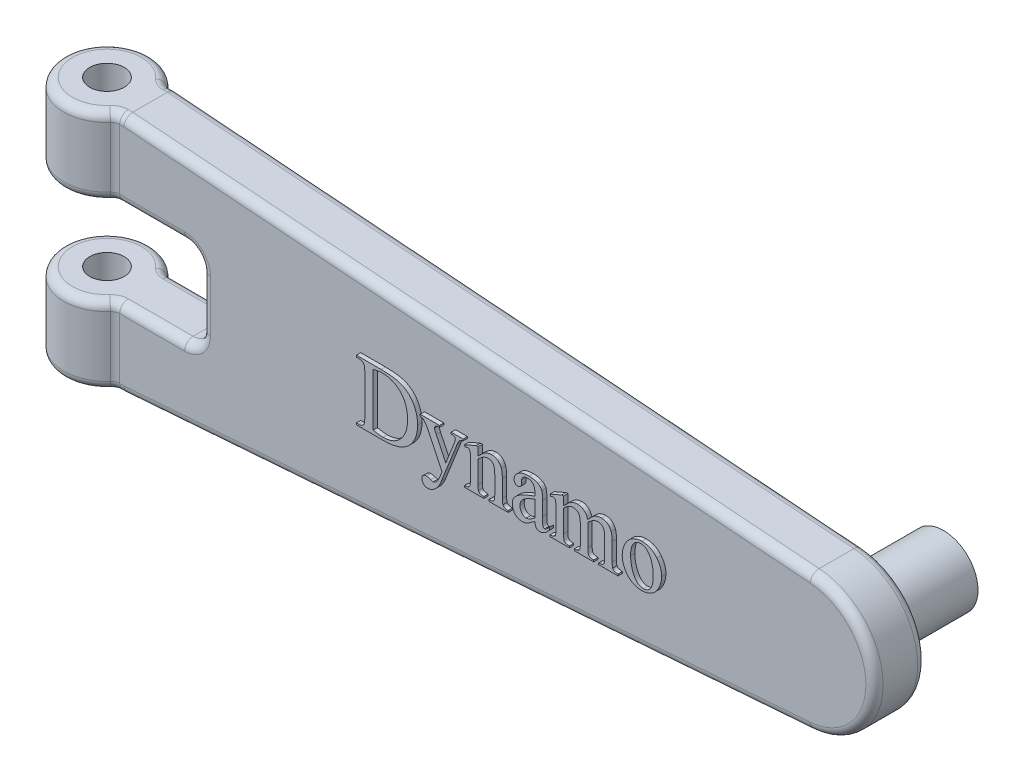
from build123d import *

# Parameters (mm, degrees)
BOSS_EXTRU_1_DEPTH      = 3
ESQUISSE2_R             = 2.5
BOSS_EXTRU_2_DEPTH      = 4.5
ESQUISSE3_R             = 1
ENL_V_MAT_EXTRU_1_DEPTH = 49.249352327
CONG_1_R                = 0.5
BOSS_EXTRU_3_DEPTH      = 0.25
ESQUISSE5_R             = 2
BOSS_EXTRU_4_DEPTH      = 5
TROU_TARAUD_M21_D       = 1.6
TROU_TARAUD_M21_DEPTH   = 6
TROU_TARAUD_M21_TIP     = 0.480688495


with BuildPart() as part:
    # Esquisse1 → Boss.-Extru.1 (new body)
    with BuildSketch(Plane.XY):
        with BuildLine():
            Line((0, 7), (2.5, 7))
            Line((2.5, 7), (42.301777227, 3.988600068))
            ThreePointArc((42.301777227, 3.988600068), (46, 0), (42.301777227, -3.988600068))
            Line((42.301777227, -3.988600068), (2.5, -7))
            Line((2.5, -7), (0, -7))
            Line((0, -7), (0, -2.5))
            Line((0, -2.5), (6, -2.5))
            ThreePointArc((6, -2.5), (6.707106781, -2.207106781), (7, -1.5))
            Line((7, -1.5), (7, 1.5))
            ThreePointArc((7, 1.5), (6.707106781, 2.207106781), (6, 2.5))
            Line((6, 2.5), (0, 2.5))
            Line((0, 2.5), (0, 7))
        make_face()
    extrude(amount=BOSS_EXTRU_1_DEPTH)

    # Esquisse2 → Boss.-Extru.2 (add)
    with BuildSketch(Plane(origin=(0, 7, 0), x_dir=(1, 0, 0), z_dir=(0, 1, 0))):
        with Locations((0, -1.5)):
            Circle(ESQUISSE2_R)
    boss_extru_2 = extrude(amount=-BOSS_EXTRU_2_DEPTH)

    # Sym_trie1: Boss.-Extru.2 across plane
    add(boss_extru_2.mirror(Plane.ZX))

    # Esquisse3 → Enl_v. mat.-Extru.1 (cut, through all)
    with BuildSketch(Plane(origin=(0, 7, 0), x_dir=(1, 0, 0), z_dir=(0, 1, 0))):
        with Locations(Location((0, -1.5, 0), (0, 0, 180))):
            Circle(ESQUISSE3_R)
    extrude(amount=-ENL_V_MAT_EXTRU_1_DEPTH, mode=Mode.SUBTRACT)

    # Cong_1
    cong_1_edges = [part.edges().sort_by_distance(p)[0] for p in [
        (6.707106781, -2.207106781, 0),
        (7, 0, 0),
        (6.707106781, 2.207106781, 0),
        (2.25, 7, 0),
        (22.400888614, -5.494300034, 3),
        (22.400888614, 5.494300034, 0),
        (46, 0, 0),
        (22.400888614, -5.494300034, 0),
        (4, -2.5, 0),
        (46, 0, 3),
        (22.400888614, 5.494300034, 3),
        (2.25, 7, 3),
        (6.707106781, 2.207106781, 3),
        (4, 2.5, 0),
        (7, 0, 3),
        (2, 4.75, 0),
        (4, 2.5, 3),
        (6.707106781, -2.207106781, 3),
        (-2.5, 2.5, 1.5),
        (2, 4.75, 3),
        (-2.5, 7, 1.5),
        (4, -2.5, 3),
        (2.25, -7, 0),
        (2, -4.75, 0),
        (2.25, -7, 3),
        (2, -4.75, 3),
        (-2.5, -7, 1.5),
        (-2.5, -2.5, 1.5),
    ]]
    fillet(cong_1_edges, radius=CONG_1_R)

    # Esquisse4 → Boss.-Extru.3 (add)
    # profile 1 of 6: a face of its own
    with BuildSketch(Plane.XY.offset(3)):
        with BuildLine():
            Line((16.212428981, -1.468545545), (16.212428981, -1.371323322))
            Line((16.212428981, -1.371323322), (16.339273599, -1.371323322))
            add(Edge.make_bspline(
                [(16.339273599, -1.371323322), (16.35651346, -1.370916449), (16.389872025, -1.370129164), (16.438021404, -1.363220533), (16.482375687, -1.351878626), (16.522964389, -1.336218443), (16.558980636, -1.314950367), (16.592334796, -1.291046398), (16.620683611, -1.260806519), (16.636060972, -1.237870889), (16.643852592, -1.226249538)],
                knots=[0, 0, 0, 0, 1.170016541, 2.263943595, 3.293731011, 4.273677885, 5.205400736, 6.126759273, 7.050839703, 8, 8, 8, 8], degree=3))
            add(Edge.make_bspline(
                [(16.643852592, -1.226249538), (16.648381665, -1.217998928), (16.65835203, -1.199835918), (16.669347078, -1.167536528), (16.67799929, -1.128768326), (16.685678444, -1.083384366), (16.691397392, -1.031390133), (16.696181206, -0.972387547), (16.698071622, -0.906745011), (16.698379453, -0.860653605), (16.698540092, -0.8366011)],
                knots=[0, 0, 0, 0, 0.568141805, 1.250715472, 2.052584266, 2.968455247, 4.031571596, 5.213625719, 6.545948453, 8, 8, 8, 8], degree=3))
            Line((16.698540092, -0.8366011), (16.698540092, 1.399510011))
            add(Edge.make_bspline(
                [(16.698540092, 1.399510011), (16.69857576, 1.426102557), (16.698643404, 1.476534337), (16.694288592, 1.548436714), (16.689521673, 1.612606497), (16.68207557, 1.668926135), (16.672369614, 1.717507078), (16.660276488, 1.758043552), (16.647508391, 1.79213945), (16.634596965, 1.80987042), (16.62866162, 1.818021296)],
                knots=[0, 0, 0, 0, 1.484107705, 2.814555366, 4.019988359, 5.075390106, 5.984573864, 6.780592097, 7.4394417, 8, 8, 8, 8], degree=3))
            add(Edge.make_bspline(
                [(16.62866162, 1.818021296), (16.611243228, 1.835992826), (16.576227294, 1.872120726), (16.507171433, 1.908929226), (16.426875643, 1.930153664), (16.369545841, 1.932822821), (16.339273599, 1.934232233)],
                knots=[0, 0, 0, 0, 0.928124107, 1.865794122, 2.873060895, 4, 4, 4, 4], degree=3))
            Line((16.339273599, 1.934232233), (16.212428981, 1.934232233))
            Line((16.212428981, 1.934232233), (16.212428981, 2.031454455))
            Line((16.212428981, 2.031454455), (17.646456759, 2.031454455))
            add(Edge.make_bspline(
                [(17.646456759, 2.031454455), (17.710268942, 2.030854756), (17.834152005, 2.029690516), (18.014009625, 2.021212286), (18.182308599, 2.00801288), (18.338433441, 1.988418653), (18.482903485, 1.963288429), (18.615781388, 1.933581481), (18.736848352, 1.897208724), (18.847010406, 1.854992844), (18.949083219, 1.806615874), (19.044557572, 1.750202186), (19.135236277, 1.68702261), (19.221112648, 1.616712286), (19.301258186, 1.538362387), (19.376952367, 1.453030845), (19.446789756, 1.359746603), (19.511811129, 1.26021425), (19.57030238, 1.154662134), (19.621133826, 1.044411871), (19.664473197, 0.930191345), (19.700473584, 0.812050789), (19.727805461, 0.689644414), (19.74614569, 0.563157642), (19.759226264, 0.432876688), (19.760429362, 0.34453076), (19.761040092, 0.299683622)],
                knots=[0, 0, 0, 0, 1.467398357, 2.848763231, 4.139747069, 5.348651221, 6.465709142, 7.510884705, 8.477890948, 9.369935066, 10.221521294, 11.072291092, 11.917022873, 12.760911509, 13.621447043, 14.491775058, 15.381421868, 16.298684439, 17.223858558, 18.153856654, 19.088127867, 20.031156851, 20.991691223, 21.969088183, 22.969046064, 24, 24, 24, 24], degree=3))
            add(Edge.make_bspline(
                [(19.761040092, 0.299683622), (19.759862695, 0.239863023), (19.757554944, 0.122611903), (19.735398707, -0.049395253), (19.700790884, -0.213893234), (19.652226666, -0.371256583), (19.588865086, -0.52077616), (19.511385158, -0.662639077), (19.42166209, -0.798299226), (19.350314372, -0.880381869), (19.314425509, -0.921670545)],
                knots=[0, 0, 0, 0, 1.077719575, 2.112379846, 3.120154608, 4.104514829, 5.075810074, 6.041644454, 7.014920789, 8, 8, 8, 8], degree=3))
            add(Edge.make_bspline(
                [(19.314425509, -0.921670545), (19.29319472, -0.9439912), (19.250582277, -0.988791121), (19.181339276, -1.050730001), (19.108350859, -1.108649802), (19.031123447, -1.162023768), (18.950009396, -1.211300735), (18.86462299, -1.256418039), (18.774792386, -1.296283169), (18.681432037, -1.333025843), (18.583670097, -1.364763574), (18.482109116, -1.392923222), (18.376147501, -1.416543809), (18.266052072, -1.435138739), (18.152093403, -1.450558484), (18.03399329, -1.461086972), (17.911855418, -1.467074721), (17.829008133, -1.468050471), (17.786973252, -1.468545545)],
                knots=[0, 0, 0, 0, 0.884547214, 1.775380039, 2.665826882, 3.559504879, 4.469980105, 5.390593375, 6.331323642, 7.291529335, 8.271228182, 9.282197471, 10.317896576, 11.387954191, 12.488469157, 13.620281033, 14.792583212, 16, 16, 16, 16], degree=3))
            Line((17.786973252, -1.468545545), (16.212428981, -1.468545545))
        make_face()
        with BuildLine():
            add(Edge.make_bspline(
                [(17.184651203, -1.248276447), (17.238473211, -1.259753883), (17.341162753, -1.281652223), (17.489598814, -1.303734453), (17.624077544, -1.319890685), (17.709458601, -1.32180753), (17.74975537, -1.322712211)],
                knots=[0, 0, 0, 0, 1.156263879, 2.206090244, 3.153339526, 4, 4, 4, 4], degree=3))
            add(Edge.make_bspline(
                [(17.74975537, -1.322712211), (17.799961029, -1.321460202), (17.898777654, -1.318995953), (18.043481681, -1.297726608), (18.182042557, -1.264582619), (18.314035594, -1.217340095), (18.439340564, -1.156204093), (18.557816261, -1.081337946), (18.668894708, -0.992256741), (18.773836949, -0.89188328), (18.868214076, -0.77882222), (18.951794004, -0.655999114), (19.021726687, -0.523128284), (19.078783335, -0.380746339), (19.123757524, -0.228978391), (19.155247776, -0.067235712), (19.174591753, 0.104006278), (19.176652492, 0.221397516), (19.177706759, 0.281454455)],
                knots=[0, 0, 0, 0, 0.997996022, 1.964292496, 2.902202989, 3.827540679, 4.746320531, 5.669683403, 6.608607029, 7.573643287, 8.552931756, 9.531909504, 10.522958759, 11.532773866, 12.577887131, 13.666093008, 14.805981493, 16, 16, 16, 16], degree=3))
            add(Edge.make_bspline(
                [(19.177706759, 0.281454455), (19.176654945, 0.342016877), (19.174603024, 0.4601646), (19.155334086, 0.632182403), (19.123647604, 0.794389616), (19.078774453, 0.946674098), (19.021880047, 1.089641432), (18.951966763, 1.222566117), (18.868232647, 1.34483222), (18.773520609, 1.457025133), (18.669027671, 1.557970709), (18.556173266, 1.645783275), (18.435889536, 1.719917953), (18.308661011, 1.781485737), (18.173114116, 1.827061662), (18.031506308, 1.861957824), (17.882215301, 1.881623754), (17.780445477, 1.884270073), (17.728488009, 1.885621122)],
                knots=[0, 0, 0, 0, 1.193396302, 2.328127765, 3.406675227, 4.447298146, 5.452780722, 6.435033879, 7.401194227, 8.367973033, 9.324444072, 10.259799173, 11.180785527, 12.104889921, 13.03919269, 13.994204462, 14.975963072, 16, 16, 16, 16], degree=3))
            add(Edge.make_bspline(
                [(17.728488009, 1.885621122), (17.687435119, 1.884718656), (17.602056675, 1.88284178), (17.470134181, 1.867491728), (17.329728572, 1.843012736), (17.234170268, 1.820548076), (17.184651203, 1.808906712)],
                knots=[0, 0, 0, 0, 0.894670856, 1.860663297, 2.891378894, 4, 4, 4, 4], degree=3))
            Line((17.184651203, 1.808906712), (17.184651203, -1.248276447))
        make_face(mode=Mode.SUBTRACT)
    # profile 2 of 6: a face of its own
    with BuildSketch(Plane.XY.offset(3)):
        with BuildLine():
            Line((19.909152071, 0.9133989), (21.030245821, 0.9133989))
            Line((21.030245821, 0.9133989), (21.030245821, 0.816176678))
            Line((21.030245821, 0.816176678), (20.97631787, 0.816176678))
            add(Edge.make_bspline(
                [(20.97631787, 0.816176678), (20.958311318, 0.815633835), (20.92431428, 0.814608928), (20.876580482, 0.806032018), (20.836312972, 0.789732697), (20.803014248, 0.768578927), (20.777440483, 0.742390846), (20.75972943, 0.712872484), (20.748243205, 0.68052767), (20.746879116, 0.657783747), (20.746174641, 0.646037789)],
                knots=[0, 0, 0, 0, 1.344755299, 2.538947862, 3.599439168, 4.569775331, 5.465769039, 6.305732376, 7.125005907, 8, 8, 8, 8], degree=3))
            add(Edge.make_bspline(
                [(20.746174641, 0.646037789), (20.747379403, 0.627971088), (20.750029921, 0.588223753), (20.76792235, 0.525089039), (20.793598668, 0.452215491), (20.81754574, 0.402006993), (20.830484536, 0.374878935)],
                knots=[0, 0, 0, 0, 0.758060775, 1.667758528, 2.739871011, 4, 4, 4, 4], degree=3))
            Line((20.830484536, 0.374878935), (21.390271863, -0.79862367))
            Line((21.390271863, -0.79862367), (21.899928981, 0.485773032))
            add(Edge.make_bspline(
                [(21.899928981, 0.485773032), (21.912650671, 0.519312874), (21.93746168, 0.584725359), (21.94133564, 0.654550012), (21.943223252, 0.688572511)],
                knots=[0, 0, 0, 0, 1.025487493, 2, 2, 2, 2], degree=3))
            add(Edge.make_bspline(
                [(21.943223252, 0.688572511), (21.942833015, 0.702053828), (21.942139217, 0.726022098), (21.930740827, 0.74699567), (21.925753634, 0.756172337)],
                knots=[0, 0, 0, 0, 1.124930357, 2, 2, 2, 2], degree=3))
            add(Edge.make_bspline(
                [(21.925753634, 0.756172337), (21.917307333, 0.76482647), (21.89890476, 0.783681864), (21.866251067, 0.798441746), (21.833063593, 0.808394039), (21.79853334, 0.813081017), (21.755927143, 0.816037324), (21.72473513, 0.816127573), (21.707763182, 0.816176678)],
                knots=[0, 0, 0, 0, 0.925469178, 2.016387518, 2.707998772, 3.596732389, 4.692353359, 6, 6, 6, 6], degree=3))
            Line((21.707763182, 0.816176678), (21.707763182, 0.9133989))
            Line((21.707763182, 0.9133989), (22.394395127, 0.9133989))
            Line((22.394395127, 0.9133989), (22.394395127, 0.816176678))
            add(Edge.make_bspline(
                [(22.394395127, 0.816176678), (22.379412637, 0.814442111), (22.351001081, 0.811152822), (22.311572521, 0.802078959), (22.277538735, 0.790510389), (22.247341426, 0.776934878), (22.220114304, 0.757035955), (22.192806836, 0.731652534), (22.164175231, 0.699607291), (22.145368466, 0.675526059), (22.13538905, 0.662747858)],
                knots=[0, 0, 0, 0, 1.154531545, 2.189358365, 3.09077396, 3.906114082, 4.713110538, 5.660092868, 6.758377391, 8, 8, 8, 8], degree=3))
            add(Edge.make_bspline(
                [(22.13538905, 0.662747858), (22.130443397, 0.654464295), (22.117886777, 0.633432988), (22.099653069, 0.592328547), (22.075368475, 0.536386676), (22.05782802, 0.493661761), (22.04804096, 0.469822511)],
                knots=[0, 0, 0, 0, 0.545794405, 1.385728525, 2.541313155, 4, 4, 4, 4], degree=3))
            Line((22.04804096, 0.469822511), (21.137342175, -1.821735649))
            add(Edge.make_bspline(
                [(21.137342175, -1.821735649), (21.125796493, -1.852514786), (21.10322383, -1.912690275), (21.064202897, -1.998442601), (21.02311765, -2.078534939), (20.97983048, -2.153273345), (20.933991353, -2.222501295), (20.883999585, -2.284869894), (20.832422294, -2.342395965), (20.777919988, -2.393486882), (20.722911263, -2.438996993), (20.667596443, -2.477988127), (20.613548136, -2.511467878), (20.559360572, -2.538562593), (20.505991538, -2.559705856), (20.452913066, -2.575269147), (20.400417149, -2.584765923), (20.365424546, -2.585995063), (20.348171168, -2.5866011)],
                knots=[0, 0, 0, 0, 1.356246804, 2.65156274, 3.885195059, 5.069711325, 6.214342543, 7.307608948, 8.365350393, 9.40008507, 10.387364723, 11.309231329, 12.190845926, 13.008541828, 13.805961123, 14.556556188, 15.28829869, 16, 16, 16, 16], degree=3))
            add(Edge.make_bspline(
                [(20.348171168, -2.5866011), (20.323965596, -2.585594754), (20.277335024, -2.583656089), (20.211078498, -2.564062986), (20.150432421, -2.534989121), (20.099679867, -2.491542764), (20.05689479, -2.442509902), (20.02689323, -2.387138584), (20.007479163, -2.328624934), (20.005226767, -2.287994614), (20.004095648, -2.267590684)],
                knots=[0, 0, 0, 0, 1.110792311, 2.13987424, 3.155946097, 4.182320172, 5.190815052, 6.134643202, 7.063246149, 8, 8, 8, 8], degree=3))
            add(Edge.make_bspline(
                [(20.004095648, -2.267590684), (20.00481347, -2.248493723), (20.00619571, -2.211720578), (20.021227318, -2.15978908), (20.045032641, -2.113834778), (20.078414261, -2.074659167), (20.119701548, -2.04216625), (20.169220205, -2.019636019), (20.225355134, -2.005446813), (20.265033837, -2.004018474), (20.285888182, -2.003267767)],
                knots=[0, 0, 0, 0, 1.049063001, 2.02007783, 2.949352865, 3.879464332, 4.833309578, 5.818831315, 6.853620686, 8, 8, 8, 8], degree=3))
            add(Edge.make_bspline(
                [(20.285888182, -2.003267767), (20.302383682, -2.004186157), (20.338432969, -2.006193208), (20.396174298, -2.017557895), (20.461713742, -2.036228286), (20.507510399, -2.052368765), (20.531981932, -2.060993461)],
                knots=[0, 0, 0, 0, 0.780236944, 1.705130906, 2.773732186, 4, 4, 4, 4], degree=3))
            add(Edge.make_bspline(
                [(20.531981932, -2.060993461), (20.548372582, -2.06703805), (20.577696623, -2.077852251), (20.616965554, -2.089240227), (20.645284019, -2.098366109), (20.661072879, -2.099897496), (20.667181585, -2.100489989)],
                knots=[0, 0, 0, 0, 1.483821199, 2.654661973, 3.479488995, 4, 4, 4, 4], degree=3))
            add(Edge.make_bspline(
                [(20.667181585, -2.100489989), (20.680691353, -2.099231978), (20.709145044, -2.096582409), (20.752321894, -2.081535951), (20.795550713, -2.054940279), (20.842955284, -2.020779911), (20.88958406, -1.969289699), (20.936379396, -1.901112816), (20.982200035, -1.814223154), (21.010450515, -1.749532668), (21.02568853, -1.714639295)],
                knots=[0, 0, 0, 0, 0.585981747, 1.234169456, 1.956103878, 2.778184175, 3.755257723, 4.944167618, 6.351715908, 8, 8, 8, 8], degree=3))
            Line((21.02568853, -1.714639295), (21.172281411, -1.347017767))
            Line((21.172281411, -1.347017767), (20.326903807, 0.427287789))
            add(Edge.make_bspline(
                [(20.326903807, 0.427287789), (20.319718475, 0.4413), (20.304189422, 0.471583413), (20.275775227, 0.518162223), (20.242474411, 0.57009788), (20.217193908, 0.605391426), (20.203856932, 0.624010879)],
                knots=[0, 0, 0, 0, 0.813263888, 1.757638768, 2.817020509, 4, 4, 4, 4], degree=3))
            add(Edge.make_bspline(
                [(20.203856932, 0.624010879), (20.193815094, 0.637747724), (20.175161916, 0.663264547), (20.148094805, 0.697682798), (20.123384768, 0.724640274), (20.106515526, 0.738594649), (20.099039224, 0.744779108)],
                knots=[0, 0, 0, 0, 1.27261881, 2.363948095, 3.274915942, 4, 4, 4, 4], degree=3))
            add(Edge.make_bspline(
                [(20.099039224, 0.744779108), (20.087770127, 0.751588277), (20.063203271, 0.7664324), (20.020031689, 0.785473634), (19.967512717, 0.801354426), (19.929447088, 0.811022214), (19.909152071, 0.816176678)],
                knots=[0, 0, 0, 0, 0.774443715, 1.6883028, 2.767498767, 4, 4, 4, 4], degree=3))
            Line((19.909152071, 0.816176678), (19.909152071, 0.9133989))
        make_face()
    # profile 3 of 6: a face of its own
    with BuildSketch(Plane.XY.offset(3)):
        with BuildLine():
            add(Edge.make_bspline(
                [(23.261040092, 0.485013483), (23.294980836, 0.522698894), (23.360451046, 0.595392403), (23.463030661, 0.692928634), (23.564689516, 0.77518836), (23.664813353, 0.843035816), (23.763814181, 0.896335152), (23.862307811, 0.933902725), (23.959754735, 0.957224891), (24.024521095, 0.960435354), (24.056287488, 0.962010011)],
                knots=[0, 0, 0, 0, 1.274487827, 2.458431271, 3.553720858, 4.558058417, 5.494704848, 6.372903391, 7.201946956, 8, 8, 8, 8], degree=3))
            add(Edge.make_bspline(
                [(24.056287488, 0.962010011), (24.08779144, 0.96096846), (24.148832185, 0.958950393), (24.236701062, 0.939705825), (24.318297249, 0.910764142), (24.392631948, 0.866892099), (24.460686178, 0.810089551), (24.520204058, 0.736767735), (24.573161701, 0.64862413), (24.59980674, 0.582181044), (24.613796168, 0.547296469)],
                knots=[0, 0, 0, 0, 1.009890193, 1.956721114, 2.874683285, 3.777956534, 4.712428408, 5.70516703, 6.795145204, 8, 8, 8, 8], degree=3))
            add(Edge.make_bspline(
                [(24.613796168, 0.547296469), (24.622889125, 0.518355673), (24.642915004, 0.454617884), (24.658216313, 0.345417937), (24.668915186, 0.216361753), (24.670117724, 0.123248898), (24.670762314, 0.073338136)],
                knots=[0, 0, 0, 0, 0.758265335, 1.669966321, 2.751045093, 4, 4, 4, 4], degree=3))
            Line((24.670762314, 0.073338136), (24.670762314, -0.933823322))
            add(Edge.make_bspline(
                [(24.670762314, -0.933823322), (24.671164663, -0.968024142), (24.671898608, -1.030411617), (24.67773652, -1.114831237), (24.686576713, -1.182060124), (24.699400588, -1.219280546), (24.704942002, -1.235364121)],
                knots=[0, 0, 0, 0, 1.345312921, 2.454054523, 3.331970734, 4, 4, 4, 4], degree=3))
            add(Edge.make_bspline(
                [(24.704942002, -1.235364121), (24.715419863, -1.255180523), (24.736373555, -1.294809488), (24.781761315, -1.333351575), (24.829922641, -1.354166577), (24.879792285, -1.363493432), (24.941213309, -1.370419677), (24.986451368, -1.371005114), (25.011040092, -1.371323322)],
                knots=[0, 0, 0, 0, 1.117480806, 2.234745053, 2.900190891, 3.732282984, 4.767403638, 6, 6, 6, 6], degree=3))
            Line((25.011040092, -1.371323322), (25.011040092, -1.468545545))
            Line((25.011040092, -1.468545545), (23.892984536, -1.468545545))
            Line((23.892984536, -1.468545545), (23.892984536, -1.371323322))
            Line((23.892984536, -1.371323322), (23.937038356, -1.371323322))
            add(Edge.make_bspline(
                [(23.937038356, -1.371323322), (23.959594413, -1.370799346), (24.001380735, -1.369828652), (24.058936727, -1.361513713), (24.105514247, -1.345628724), (24.142903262, -1.323831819), (24.170768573, -1.294019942), (24.193550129, -1.25949563), (24.212189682, -1.219316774), (24.220044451, -1.189944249), (24.224147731, -1.174600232)],
                knots=[0, 0, 0, 0, 1.402756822, 2.598683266, 3.599601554, 4.447518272, 5.26035404, 6.111917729, 7.013678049, 8, 8, 8, 8], degree=3))
            add(Edge.make_bspline(
                [(24.224147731, -1.174600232), (24.225530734, -1.164737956), (24.229239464, -1.138290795), (24.231454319, -1.08828319), (24.232761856, -1.017892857), (24.233081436, -0.964208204), (24.233262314, -0.933823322)],
                knots=[0, 0, 0, 0, 0.495412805, 1.328523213, 2.48797557, 4, 4, 4, 4], degree=3))
            Line((24.233262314, -0.933823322), (24.233262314, 0.047513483))
            add(Edge.make_bspline(
                [(24.233262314, 0.047513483), (24.232936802, 0.073849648), (24.232307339, 0.124777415), (24.228468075, 0.198246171), (24.222672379, 0.266215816), (24.213787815, 0.328407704), (24.20151714, 0.3849217), (24.187139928, 0.435931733), (24.170932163, 0.481771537), (24.15076472, 0.521889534), (24.128203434, 0.557110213), (24.101670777, 0.587642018), (24.071626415, 0.613131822), (24.037826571, 0.63425415), (24.00087784, 0.650981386), (23.959855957, 0.66220843), (23.915504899, 0.669171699), (23.884657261, 0.669943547), (23.868678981, 0.670343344)],
                knots=[0, 0, 0, 0, 1.539222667, 2.976484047, 4.298769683, 5.525087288, 6.645404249, 7.675929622, 8.621580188, 9.481872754, 10.294522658, 11.060140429, 11.836973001, 12.588300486, 13.383105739, 14.198177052, 15.06670227, 16, 16, 16, 16], degree=3))
            add(Edge.make_bspline(
                [(23.868678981, 0.670343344), (23.843280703, 0.669300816), (23.791993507, 0.667195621), (23.715353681, 0.650389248), (23.639108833, 0.623342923), (23.562382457, 0.586699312), (23.486395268, 0.538175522), (23.410625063, 0.47920845), (23.333877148, 0.410706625), (23.285917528, 0.358608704), (23.261040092, 0.331584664)],
                knots=[0, 0, 0, 0, 0.85022098, 1.716866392, 2.615460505, 3.556252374, 4.55868006, 5.629125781, 6.770188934, 8, 8, 8, 8], degree=3))
            Line((23.261040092, 0.331584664), (23.261040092, -0.933823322))
            add(Edge.make_bspline(
                [(23.261040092, -0.933823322), (23.261249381, -0.969790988), (23.261622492, -1.033912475), (23.265875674, -1.118789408), (23.272436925, -1.181454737), (23.282240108, -1.214672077), (23.286105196, -1.227768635)],
                knots=[0, 0, 0, 0, 1.457443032, 2.5982619, 3.447338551, 4, 4, 4, 4], degree=3))
            add(Edge.make_bspline(
                [(23.286105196, -1.227768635), (23.29156134, -1.239622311), (23.302049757, -1.26240879), (23.323174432, -1.292140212), (23.34586805, -1.318042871), (23.374322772, -1.33946572), (23.412534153, -1.354849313), (23.463137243, -1.364676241), (23.527523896, -1.370071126), (23.575228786, -1.370880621), (23.60131787, -1.371323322)],
                knots=[0, 0, 0, 0, 0.834471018, 1.604114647, 2.327743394, 3.035183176, 3.863955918, 4.942799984, 6.328063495, 8, 8, 8, 8], degree=3))
            Line((23.60131787, -1.371323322), (23.60131787, -1.468545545))
            Line((23.60131787, -1.468545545), (22.483262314, -1.468545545))
            Line((22.483262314, -1.468545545), (22.483262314, -1.371323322))
            Line((22.483262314, -1.371323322), (22.531873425, -1.371323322))
            add(Edge.make_bspline(
                [(22.531873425, -1.371323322), (22.558337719, -1.370673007), (22.607158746, -1.369473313), (22.673509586, -1.351781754), (22.727135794, -1.323787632), (22.767892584, -1.280557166), (22.793998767, -1.22023988), (22.810913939, -1.142512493), (22.821945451, -1.045019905), (22.822976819, -0.973101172), (22.823540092, -0.933823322)],
                knots=[0, 0, 0, 0, 1.030840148, 1.90168213, 2.658604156, 3.365205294, 4.174760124, 5.191798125, 6.466322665, 8, 8, 8, 8], degree=3))
            Line((22.823540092, -0.933823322), (22.823540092, -0.010212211))
            add(Edge.make_bspline(
                [(22.823540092, -0.010212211), (22.8235857, 0.02067574), (22.823672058, 0.079161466), (22.823099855, 0.161963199), (22.821114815, 0.235113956), (22.820510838, 0.29897764), (22.816473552, 0.353329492), (22.815271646, 0.398273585), (22.811122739, 0.433432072), (22.806429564, 0.467024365), (22.799119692, 0.500180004), (22.786811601, 0.532846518), (22.773604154, 0.559567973), (22.751974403, 0.585381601), (22.715608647, 0.608041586), (22.682399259, 0.610535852), (22.664794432, 0.611858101)],
                knots=[0, 0, 0, 0, 1.850123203, 3.503171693, 4.959322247, 6.233538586, 7.32709827, 8.222985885, 8.92468213, 9.445835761, 10.25513813, 10.950910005, 11.53431706, 12.029447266, 12.955378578, 14, 14, 14, 14], degree=3))
            add(Edge.make_bspline(
                [(22.664794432, 0.611858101), (22.653867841, 0.611424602), (22.630760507, 0.610507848), (22.595185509, 0.602169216), (22.556649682, 0.589809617), (22.530529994, 0.578903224), (22.516682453, 0.573121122)],
                knots=[0, 0, 0, 0, 0.849806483, 1.797153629, 2.832145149, 4, 4, 4, 4], degree=3))
            Line((22.516682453, 0.573121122), (22.483262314, 0.670343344))
            Line((22.483262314, 0.670343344), (23.156222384, 0.962010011))
            Line((23.156222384, 0.962010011), (23.261040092, 0.962010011))
            Line((23.261040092, 0.962010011), (23.261040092, 0.485013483))
        make_face()
    # profile 4 of 6: a face of its own
    with BuildSketch(Plane.XY.offset(3)):
        with BuildLine():
            add(Edge.make_bspline(
                [(26.566595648, -1.130546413), (26.537802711, -1.152666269), (26.483189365, -1.194622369), (26.404697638, -1.252678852), (26.335764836, -1.305020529), (26.27438226, -1.348581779), (26.221683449, -1.385634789), (26.177261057, -1.414830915), (26.141698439, -1.437625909), (26.120051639, -1.448668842), (26.110866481, -1.453354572)],
                knots=[0, 0, 0, 0, 1.558875, 2.95681467, 4.191698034, 5.274657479, 6.188356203, 6.95716577, 7.557505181, 8, 8, 8, 8], degree=3))
            add(Edge.make_bspline(
                [(26.110866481, -1.453354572), (26.087531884, -1.463327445), (26.041009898, -1.483210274), (25.96756267, -1.502180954), (25.892338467, -1.515325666), (25.841286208, -1.516540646), (25.815402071, -1.517156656)],
                knots=[0, 0, 0, 0, 0.998482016, 1.990665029, 2.981241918, 4, 4, 4, 4], degree=3))
            add(Edge.make_bspline(
                [(25.815402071, -1.517156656), (25.795381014, -1.516461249), (25.756208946, -1.515100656), (25.698585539, -1.507695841), (25.643860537, -1.493951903), (25.592101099, -1.474738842), (25.542613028, -1.451205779), (25.49631499, -1.421142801), (25.452090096, -1.386272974), (25.411223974, -1.345935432), (25.374130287, -1.301531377), (25.342256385, -1.25316836), (25.314139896, -1.201930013), (25.292923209, -1.146494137), (25.274758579, -1.08828761), (25.263218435, -1.026588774), (25.255070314, -0.961638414), (25.254425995, -0.917140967), (25.254095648, -0.894326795)],
                knots=[0, 0, 0, 0, 1.021269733, 1.99815853, 2.956354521, 3.891750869, 4.809880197, 5.744652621, 6.700410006, 7.677298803, 8.667491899, 9.645063, 10.627057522, 11.641202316, 12.666381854, 13.732374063, 14.837371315, 16, 16, 16, 16], degree=3))
            add(Edge.make_bspline(
                [(25.254095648, -0.894326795), (25.254729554, -0.865620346), (25.255962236, -0.809798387), (25.272454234, -0.729749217), (25.294629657, -0.654465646), (25.319342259, -0.609645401), (25.331569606, -0.587469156)],
                knots=[0, 0, 0, 0, 1.073591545, 2.087683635, 3.053820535, 4, 4, 4, 4], degree=3))
            add(Edge.make_bspline(
                [(25.331569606, -0.587469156), (25.35145067, -0.557409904), (25.39320771, -0.494275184), (25.47738767, -0.409149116), (25.579394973, -0.325970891), (25.679144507, -0.260462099), (25.77103981, -0.206762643), (25.853156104, -0.164950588), (25.945610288, -0.119952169), (26.048276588, -0.071926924), (26.163029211, -0.023791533), (26.287804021, 0.027713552), (26.423253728, 0.082093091), (26.517652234, 0.117344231), (26.566595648, 0.135621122)],
                knots=[0, 0, 0, 0, 0.890335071, 1.870008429, 2.947759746, 4.145438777, 4.819447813, 5.581919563, 6.425634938, 7.365025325, 8.387143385, 9.505655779, 10.706740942, 12, 12, 12, 12], degree=3))
            Line((26.566595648, 0.135621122), (26.566595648, 0.22448831))
            add(Edge.make_bspline(
                [(26.566595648, 0.22448831), (26.566366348, 0.251584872), (26.5659244, 0.303810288), (26.56084098, 0.378928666), (26.551256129, 0.447236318), (26.540883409, 0.50929369), (26.524563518, 0.564027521), (26.505821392, 0.612624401), (26.48315889, 0.654557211), (26.448700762, 0.701360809), (26.395828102, 0.748466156), (26.319830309, 0.788846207), (26.231011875, 0.812638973), (26.167731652, 0.814956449), (26.134412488, 0.816176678)],
                knots=[0, 0, 0, 0, 1.156239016, 2.228513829, 3.209486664, 4.099496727, 4.909803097, 5.642093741, 6.318967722, 6.93697649, 8.115067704, 9.304155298, 10.580547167, 12, 12, 12, 12], degree=3))
            add(Edge.make_bspline(
                [(26.134412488, 0.816176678), (26.108968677, 0.815362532), (26.060255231, 0.81380381), (25.991511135, 0.796237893), (25.929910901, 0.769804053), (25.896402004, 0.742314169), (25.879963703, 0.728828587)],
                knots=[0, 0, 0, 0, 1.106638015, 2.118713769, 3.077106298, 4, 4, 4, 4], degree=3))
            add(Edge.make_bspline(
                [(25.879963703, 0.728828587), (25.865066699, 0.714486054), (25.836600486, 0.687079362), (25.806454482, 0.637412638), (25.786891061, 0.584937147), (25.784632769, 0.54822506), (25.78350103, 0.529826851)],
                knots=[0, 0, 0, 0, 1.084622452, 2.072570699, 3.034071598, 4, 4, 4, 4], degree=3))
            Line((25.78350103, 0.529826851), (25.78881787, 0.380955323))
            add(Edge.make_bspline(
                [(25.78881787, 0.380955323), (25.788192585, 0.362399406), (25.787005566, 0.327173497), (25.775310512, 0.277541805), (25.756760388, 0.234154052), (25.729263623, 0.198650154), (25.696611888, 0.170097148), (25.658069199, 0.149990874), (25.614907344, 0.137390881), (25.584336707, 0.136223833), (25.568548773, 0.135621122)],
                knots=[0, 0, 0, 0, 1.192988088, 2.264727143, 3.264608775, 4.207008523, 5.131898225, 6.036298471, 6.985863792, 8, 8, 8, 8], degree=3))
            add(Edge.make_bspline(
                [(25.568548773, 0.135621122), (25.553227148, 0.136116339), (25.523498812, 0.137077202), (25.481830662, 0.151331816), (25.443250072, 0.170715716), (25.410861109, 0.200279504), (25.383554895, 0.23630151), (25.364934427, 0.279585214), (25.353168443, 0.32843112), (25.351953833, 0.362904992), (25.35131787, 0.380955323)],
                knots=[0, 0, 0, 0, 0.992015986, 1.924794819, 2.838757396, 3.784255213, 4.749783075, 5.760236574, 6.827272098, 8, 8, 8, 8], degree=3))
            add(Edge.make_bspline(
                [(25.35131787, 0.380955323), (25.352080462, 0.398988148), (25.353597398, 0.434858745), (25.36488744, 0.487899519), (25.382107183, 0.539950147), (25.407893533, 0.590374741), (25.440060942, 0.63990683), (25.4788791, 0.688842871), (25.525648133, 0.735672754), (25.578644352, 0.78133023), (25.638232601, 0.8235647), (25.703739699, 0.860990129), (25.775346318, 0.892283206), (25.852403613, 0.917844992), (25.935537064, 0.937595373), (26.024113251, 0.951923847), (26.118559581, 0.960162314), (26.183260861, 0.961383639), (26.216443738, 0.962010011)],
                knots=[0, 0, 0, 0, 0.751350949, 1.494574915, 2.252349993, 3.031299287, 3.848234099, 4.712108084, 5.630260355, 6.603499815, 7.625714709, 8.670571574, 9.743474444, 10.878456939, 12.051105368, 13.302367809, 14.616484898, 16, 16, 16, 16], degree=3))
            add(Edge.make_bspline(
                [(26.216443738, 0.962010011), (26.266652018, 0.960758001), (26.362930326, 0.958357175), (26.500006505, 0.93863843), (26.623831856, 0.90653902), (26.697408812, 0.87172449), (26.732936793, 0.854913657)],
                knots=[0, 0, 0, 0, 1.131049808, 2.168876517, 3.115808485, 4, 4, 4, 4], degree=3))
            add(Edge.make_bspline(
                [(26.732936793, 0.854913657), (26.757355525, 0.840327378), (26.805978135, 0.811283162), (26.868273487, 0.752015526), (26.919878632, 0.681242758), (26.944950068, 0.627785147), (26.957763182, 0.600464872)],
                knots=[0, 0, 0, 0, 0.983173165, 1.957695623, 2.956251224, 4, 4, 4, 4], degree=3))
            add(Edge.make_bspline(
                [(26.957763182, 0.600464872), (26.961442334, 0.589875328), (26.969495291, 0.566696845), (26.979579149, 0.527451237), (26.986196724, 0.480534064), (26.99364457, 0.426702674), (26.997455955, 0.365278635), (27.001533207, 0.296691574), (27.003687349, 0.220450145), (27.003955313, 0.167269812), (27.004095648, 0.139418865)],
                knots=[0, 0, 0, 0, 0.578071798, 1.265288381, 2.085304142, 3.019791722, 4.067310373, 5.257317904, 6.563636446, 8, 8, 8, 8], degree=3))
            Line((27.004095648, 0.139418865), (27.004095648, -0.675576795))
            add(Edge.make_bspline(
                [(27.004095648, -0.675576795), (27.004007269, -0.702921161), (27.003840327, -0.75457295), (27.004947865, -0.827991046), (27.005264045, -0.892820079), (27.00716908, -0.949518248), (27.008215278, -0.997909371), (27.010804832, -1.038141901), (27.01264015, -1.07010966), (27.016444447, -1.100398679), (27.023054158, -1.129607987), (27.031614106, -1.158967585), (27.042995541, -1.182057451), (27.059534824, -1.204557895), (27.087559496, -1.220979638), (27.111513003, -1.223998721), (27.12334478, -1.225489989)],
                knots=[0, 0, 0, 0, 1.895498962, 3.580478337, 5.089959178, 6.389201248, 7.513008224, 8.444695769, 9.183712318, 9.732301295, 10.558500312, 11.257899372, 11.846575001, 12.334540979, 13.177350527, 14, 14, 14, 14], degree=3))
            add(Edge.make_bspline(
                [(27.12334478, -1.225489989), (27.13594079, -1.224737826), (27.160004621, -1.22330087), (27.181987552, -1.213466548), (27.192463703, -1.20877992)],
                knots=[0, 0, 0, 0, 1.04688317, 2, 2, 2, 2], degree=3))
            add(Edge.make_bspline(
                [(27.192463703, -1.20877992), (27.203249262, -1.201378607), (27.230036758, -1.182996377), (27.272684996, -1.143908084), (27.329835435, -1.093321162), (27.370410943, -1.053306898), (27.392984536, -1.031045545)],
                knots=[0, 0, 0, 0, 0.584543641, 1.451798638, 2.582345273, 4, 4, 4, 4], degree=3))
            Line((27.392984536, -1.031045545), (27.392984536, -1.167004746))
            add(Edge.make_bspline(
                [(27.392984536, -1.167004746), (27.36953427, -1.194658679), (27.324426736, -1.247852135), (27.253879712, -1.319507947), (27.18371532, -1.379911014), (27.114736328, -1.429971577), (27.046005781, -1.468228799), (26.978365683, -1.496243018), (26.911086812, -1.514108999), (26.865959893, -1.516153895), (26.843830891, -1.517156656)],
                knots=[0, 0, 0, 0, 1.29495671, 2.490901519, 3.587659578, 4.59909354, 5.530268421, 6.390197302, 7.210596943, 8, 8, 8, 8], degree=3))
            add(Edge.make_bspline(
                [(26.843830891, -1.517156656), (26.823689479, -1.51631879), (26.784913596, -1.514705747), (26.730217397, -1.497067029), (26.682088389, -1.469335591), (26.640113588, -1.429955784), (26.60665934, -1.376077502), (26.584540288, -1.307092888), (26.568978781, -1.223890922), (26.567431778, -1.163296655), (26.566595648, -1.130546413)],
                knots=[0, 0, 0, 0, 0.892412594, 1.718056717, 2.524775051, 3.344648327, 4.249949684, 5.310413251, 6.546320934, 8, 8, 8, 8], degree=3))
        make_face()
        with BuildLine():
            Line((26.566595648, -0.955090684), (26.566595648, -0.010212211))
            add(Edge.make_bspline(
                [(26.566595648, -0.010212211), (26.535717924, -0.023401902), (26.476989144, -0.048488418), (26.392872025, -0.083974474), (26.317869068, -0.11759065), (26.251139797, -0.147670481), (26.193214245, -0.17514946), (26.143818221, -0.199413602), (26.102672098, -0.220473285), (26.078421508, -0.23420991), (26.06757221, -0.24035544)],
                knots=[0, 0, 0, 0, 1.465697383, 2.787725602, 3.985057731, 5.053380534, 5.982790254, 6.783498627, 7.455758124, 8, 8, 8, 8], degree=3))
            add(Edge.make_bspline(
                [(26.06757221, -0.24035544), (26.035747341, -0.259721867), (25.975388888, -0.296451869), (25.895791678, -0.358714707), (25.829466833, -0.421393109), (25.777785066, -0.48677039), (25.738397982, -0.55420733), (25.712400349, -0.624793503), (25.694215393, -0.697957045), (25.692476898, -0.748127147), (25.691595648, -0.773558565)],
                knots=[0, 0, 0, 0, 1.302370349, 2.470051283, 3.52876103, 4.487475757, 5.376328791, 6.248248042, 7.112030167, 8, 8, 8, 8], degree=3))
            add(Edge.make_bspline(
                [(25.691595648, -0.773558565), (25.692784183, -0.804825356), (25.695073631, -0.865053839), (25.716291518, -0.951598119), (25.751278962, -1.02965047), (25.799177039, -1.097784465), (25.855406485, -1.153899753), (25.917651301, -1.195434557), (25.985016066, -1.220374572), (26.031424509, -1.223783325), (26.054659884, -1.225489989)],
                knots=[0, 0, 0, 0, 1.168223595, 2.250321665, 3.310218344, 4.350849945, 5.348877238, 6.265796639, 7.13173418, 8, 8, 8, 8], degree=3))
            add(Edge.make_bspline(
                [(26.054659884, -1.225489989), (26.07168129, -1.224428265), (26.107118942, -1.222217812), (26.16209015, -1.209287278), (26.220407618, -1.187524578), (26.282698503, -1.157804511), (26.34825847, -1.118999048), (26.418290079, -1.072773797), (26.491525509, -1.017031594), (26.540914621, -0.976280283), (26.566595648, -0.955090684)],
                knots=[0, 0, 0, 0, 0.693887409, 1.444636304, 2.289794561, 3.226439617, 4.252586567, 5.391242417, 6.643515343, 8, 8, 8, 8], degree=3))
        make_face(mode=Mode.SUBTRACT)
    # profile 5 of 6: a face of its own
    with BuildSketch(Plane.XY.offset(3)):
        with BuildLine():
            add(Edge.make_bspline(
                [(28.219373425, 0.475139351), (28.23935464, 0.494907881), (28.277154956, 0.53230584), (28.330920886, 0.584887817), (28.379076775, 0.629873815), (28.419102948, 0.669876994), (28.453286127, 0.702544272), (28.481235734, 0.728270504), (28.502703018, 0.747290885), (28.514587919, 0.757940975), (28.519395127, 0.762248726)],
                knots=[0, 0, 0, 0, 1.624271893, 3.072785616, 4.345656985, 5.431980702, 6.342617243, 7.07780109, 7.626988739, 8, 8, 8, 8], degree=3))
            add(Edge.make_bspline(
                [(28.519395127, 0.762248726), (28.538647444, 0.777520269), (28.576836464, 0.807812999), (28.637847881, 0.846976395), (28.700545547, 0.881766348), (28.765424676, 0.910335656), (28.831285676, 0.932991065), (28.896960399, 0.950080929), (28.962641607, 0.960382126), (29.006483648, 0.961469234), (29.028292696, 0.962010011)],
                knots=[0, 0, 0, 0, 1.057501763, 2.097667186, 3.117350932, 4.142323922, 5.145558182, 6.11327747, 7.061457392, 8, 8, 8, 8], degree=3))
            add(Edge.make_bspline(
                [(29.028292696, 0.962010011), (29.063618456, 0.960681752), (29.13257498, 0.958088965), (29.231971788, 0.933987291), (29.323125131, 0.893531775), (29.406352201, 0.838943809), (29.479428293, 0.76886589), (29.54005422, 0.68440086), (29.586125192, 0.584931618), (29.60539441, 0.512722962), (29.615423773, 0.475139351)],
                knots=[0, 0, 0, 0, 1.019635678, 1.990347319, 2.9338198, 3.889609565, 4.852124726, 5.843003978, 6.877313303, 8, 8, 8, 8], degree=3))
            add(Edge.make_bspline(
                [(29.615423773, 0.475139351), (29.636574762, 0.499042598), (29.677547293, 0.545346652), (29.738807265, 0.610735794), (29.798249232, 0.669082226), (29.854443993, 0.721829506), (29.908121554, 0.768339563), (29.959681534, 0.807804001), (30.00855911, 0.840934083), (30.069709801, 0.875950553), (30.145836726, 0.910352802), (30.238303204, 0.94003817), (30.332476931, 0.958397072), (30.395653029, 0.960802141), (30.427381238, 0.962010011)],
                knots=[0, 0, 0, 0, 1.172872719, 2.272024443, 3.291759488, 4.233102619, 5.103992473, 5.900434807, 6.617795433, 7.272113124, 8.48792784, 9.679580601, 10.834642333, 12, 12, 12, 12], degree=3))
            add(Edge.make_bspline(
                [(30.427381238, 0.962010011), (30.457620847, 0.960946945), (30.516653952, 0.95887165), (30.602209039, 0.93950168), (30.682905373, 0.910444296), (30.757762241, 0.866772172), (30.826875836, 0.810194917), (30.888597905, 0.737812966), (30.941542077, 0.649717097), (30.969031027, 0.583905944), (30.983370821, 0.549575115)],
                knots=[0, 0, 0, 0, 0.976125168, 1.905570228, 2.822280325, 3.738953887, 4.692551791, 5.696550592, 6.798390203, 8, 8, 8, 8], degree=3))
            add(Edge.make_bspline(
                [(30.983370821, 0.549575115), (30.98782766, 0.536204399), (30.997159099, 0.508209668), (31.008759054, 0.462864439), (31.017049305, 0.412177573), (31.02602163, 0.356354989), (31.03183997, 0.294968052), (31.035064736, 0.228303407), (31.038728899, 0.156418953), (31.038787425, 0.106763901), (31.03881787, 0.080933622)],
                knots=[0, 0, 0, 0, 0.71352519, 1.493932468, 2.366501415, 3.312884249, 4.356309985, 5.486239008, 6.692355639, 8, 8, 8, 8], degree=3))
            Line((31.03881787, 0.080933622), (31.03881787, -0.933823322))
            add(Edge.make_bspline(
                [(31.03881787, -0.933823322), (31.039192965, -0.967771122), (31.039876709, -1.029653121), (31.046037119, -1.113775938), (31.054205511, -1.181056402), (31.06574335, -1.219000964), (31.070718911, -1.235364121)],
                knots=[0, 0, 0, 0, 1.337909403, 2.438818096, 3.326758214, 4, 4, 4, 4], degree=3))
            add(Edge.make_bspline(
                [(31.070718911, -1.235364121), (31.075430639, -1.244707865), (31.085020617, -1.263725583), (31.106527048, -1.288629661), (31.131387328, -1.312609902), (31.163042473, -1.333711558), (31.20273133, -1.351747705), (31.252787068, -1.362757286), (31.312512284, -1.370574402), (31.355768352, -1.37106094), (31.379095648, -1.371323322)],
                knots=[0, 0, 0, 0, 0.699593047, 1.423911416, 2.193058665, 3.012876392, 3.963272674, 5.100428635, 6.436308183, 8, 8, 8, 8], degree=3))
            Line((31.379095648, -1.371323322), (31.379095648, -1.468545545))
            Line((31.379095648, -1.468545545), (30.261040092, -1.468545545))
            Line((30.261040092, -1.468545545), (30.261040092, -1.371323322))
            Line((30.261040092, -1.371323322), (30.305093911, -1.371323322))
            add(Edge.make_bspline(
                [(30.305093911, -1.371323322), (30.326410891, -1.370593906), (30.367055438, -1.369203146), (30.424243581, -1.35887603), (30.474652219, -1.3409736), (30.502641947, -1.322041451), (30.516248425, -1.312838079)],
                knots=[0, 0, 0, 0, 1.146999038, 2.186954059, 3.118634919, 4, 4, 4, 4], degree=3))
            add(Edge.make_bspline(
                [(30.516248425, -1.312838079), (30.525008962, -1.305353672), (30.542947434, -1.290028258), (30.563030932, -1.258885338), (30.581103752, -1.223247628), (30.588387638, -1.196307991), (30.592203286, -1.182195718)],
                knots=[0, 0, 0, 0, 0.893898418, 1.830387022, 2.863452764, 4, 4, 4, 4], degree=3))
            add(Edge.make_bspline(
                [(30.592203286, -1.182195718), (30.593584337, -1.171573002), (30.597222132, -1.143591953), (30.599521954, -1.091323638), (30.600796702, -1.019156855), (30.601130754, -0.964460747), (30.60131787, -0.933823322)],
                knots=[0, 0, 0, 0, 0.516697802, 1.361021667, 2.521805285, 4, 4, 4, 4], degree=3))
            Line((30.60131787, -0.933823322), (30.60131787, 0.092326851))
            add(Edge.make_bspline(
                [(30.60131787, 0.092326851), (30.601320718, 0.115626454), (30.601326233, 0.160741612), (30.597188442, 0.22557923), (30.591780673, 0.285329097), (30.585754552, 0.339782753), (30.575400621, 0.388578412), (30.564352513, 0.43211013), (30.551032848, 0.470486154), (30.539284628, 0.493227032), (30.533718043, 0.504002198)],
                knots=[0, 0, 0, 0, 1.327957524, 2.571331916, 3.701666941, 4.748964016, 5.691570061, 6.542288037, 7.30930161, 8, 8, 8, 8], degree=3))
            add(Edge.make_bspline(
                [(30.533718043, 0.504002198), (30.525472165, 0.517173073), (30.50912656, 0.543281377), (30.478754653, 0.577252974), (30.444649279, 0.605610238), (30.407809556, 0.629902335), (30.36640481, 0.648031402), (30.321342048, 0.660500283), (30.273046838, 0.669600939), (30.239565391, 0.670090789), (30.222303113, 0.670343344)],
                knots=[0, 0, 0, 0, 1.003500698, 1.989215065, 2.930417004, 3.86590598, 4.833368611, 5.83860397, 6.885633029, 8, 8, 8, 8], degree=3))
            add(Edge.make_bspline(
                [(30.222303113, 0.670343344), (30.200212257, 0.669409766), (30.155666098, 0.667527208), (30.088916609, 0.653762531), (30.02175576, 0.632613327), (29.95340135, 0.601282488), (29.881996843, 0.558068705), (29.805166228, 0.500910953), (29.720881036, 0.429424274), (29.664448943, 0.374493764), (29.634412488, 0.345256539)],
                knots=[0, 0, 0, 0, 0.768145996, 1.54896464, 2.362390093, 3.213842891, 4.157980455, 5.260853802, 6.542066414, 8, 8, 8, 8], degree=3))
            Line((29.634412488, 0.345256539), (29.629095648, 0.31715324))
            Line((29.629095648, 0.31715324), (29.629095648, 0.204740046))
            Line((29.629095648, 0.204740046), (29.629095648, -0.933823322))
            add(Edge.make_bspline(
                [(29.629095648, -0.933823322), (29.629253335, -0.970291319), (29.629534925, -1.035414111), (29.634340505, -1.12180678), (29.639579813, -1.185767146), (29.649897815, -1.231022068), (29.666426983, -1.262936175), (29.687120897, -1.288655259), (29.7131142, -1.311670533), (29.744025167, -1.334123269), (29.785000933, -1.351720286), (29.836709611, -1.362902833), (29.899268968, -1.370552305), (29.944785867, -1.371052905), (29.969373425, -1.371323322)],
                knots=[0, 0, 0, 0, 1.960994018, 3.501848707, 4.65219803, 5.411809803, 5.978172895, 6.569363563, 7.176643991, 7.841496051, 8.615734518, 9.553706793, 10.678548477, 12, 12, 12, 12], degree=3))
            Line((29.969373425, -1.371323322), (29.969373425, -1.468545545))
            Line((29.969373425, -1.468545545), (28.85131787, -1.468545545))
            Line((28.85131787, -1.468545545), (28.85131787, -1.371323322))
            add(Edge.make_bspline(
                [(28.85131787, -1.371323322), (28.878181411, -1.370787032), (28.927253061, -1.36980739), (28.994333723, -1.361906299), (29.048018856, -1.34853763), (29.089806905, -1.327893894), (29.121315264, -1.300641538), (29.146788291, -1.268120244), (29.16654168, -1.229526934), (29.175544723, -1.201336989), (29.180202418, -1.18675301)],
                knots=[0, 0, 0, 0, 1.553593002, 2.837949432, 3.900272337, 4.738690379, 5.507576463, 6.289876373, 7.115272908, 8, 8, 8, 8], degree=3))
            add(Edge.make_bspline(
                [(29.180202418, -1.18675301), (29.182199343, -1.176145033), (29.187484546, -1.148069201), (29.188534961, -1.094810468), (29.191551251, -1.021215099), (29.191579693, -0.965229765), (29.191595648, -0.933823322)],
                knots=[0, 0, 0, 0, 0.510323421, 1.350658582, 2.51378238, 4, 4, 4, 4], degree=3))
            Line((29.191595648, -0.933823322), (29.191595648, 0.0930864))
            add(Edge.make_bspline(
                [(29.191595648, 0.0930864), (29.191284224, 0.116639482), (29.19068774, 0.161751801), (29.186723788, 0.226856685), (29.181145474, 0.286779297), (29.171803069, 0.341488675), (29.160889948, 0.391189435), (29.14625987, 0.435274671), (29.129993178, 0.474478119), (29.116159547, 0.49755679), (29.109564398, 0.50855949)],
                knots=[0, 0, 0, 0, 1.318388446, 2.525171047, 3.650559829, 4.68508758, 5.630540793, 6.49555487, 7.282759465, 8, 8, 8, 8], degree=3))
            add(Edge.make_bspline(
                [(29.109564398, 0.50855949), (29.100238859, 0.521458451), (29.082090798, 0.546560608), (29.050335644, 0.579605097), (29.016180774, 0.608055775), (28.97873711, 0.630881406), (28.938569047, 0.648518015), (28.896033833, 0.661449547), (28.850595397, 0.669302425), (28.819448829, 0.669990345), (28.803466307, 0.670343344)],
                knots=[0, 0, 0, 0, 1.054988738, 2.053071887, 3.031739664, 3.996905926, 4.952079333, 5.935206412, 6.940473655, 8, 8, 8, 8], degree=3))
            add(Edge.make_bspline(
                [(28.803466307, 0.670343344), (28.78111622, 0.669463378), (28.736254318, 0.667697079), (28.669042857, 0.653203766), (28.602277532, 0.629713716), (28.559424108, 0.607809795), (28.537624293, 0.596667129)],
                knots=[0, 0, 0, 0, 0.961472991, 1.92990323, 2.946928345, 4, 4, 4, 4], degree=3))
            add(Edge.make_bspline(
                [(28.537624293, 0.596667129), (28.504883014, 0.577957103), (28.441690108, 0.541845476), (28.35553656, 0.480911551), (28.280543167, 0.416745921), (28.239329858, 0.368579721), (28.219373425, 0.345256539)],
                knots=[0, 0, 0, 0, 1.108080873, 2.138671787, 3.098702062, 4, 4, 4, 4], degree=3))
            Line((28.219373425, 0.345256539), (28.219373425, -0.933823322))
            add(Edge.make_bspline(
                [(28.219373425, -0.933823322), (28.21955047, -0.968766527), (28.219871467, -1.032121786), (28.224664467, -1.117158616), (28.233125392, -1.182244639), (28.247607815, -1.241599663), (28.279658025, -1.29422926), (28.322596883, -1.335439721), (28.37088902, -1.354851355), (28.421462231, -1.364675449), (28.485860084, -1.370071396), (28.533563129, -1.370880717), (28.559651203, -1.371323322)],
                knots=[0, 0, 0, 0, 1.565352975, 2.838129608, 3.811754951, 4.505099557, 5.55745862, 6.529497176, 7.108825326, 7.862958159, 8.831284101, 10, 10, 10, 10], degree=3))
            Line((28.559651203, -1.371323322), (28.559651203, -1.468545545))
            Line((28.559651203, -1.468545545), (27.441595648, -1.468545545))
            Line((27.441595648, -1.468545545), (27.441595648, -1.371323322))
            add(Edge.make_bspline(
                [(27.441595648, -1.371323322), (27.465409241, -1.3708928), (27.509076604, -1.370103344), (27.568885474, -1.364457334), (27.617410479, -1.354561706), (27.655870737, -1.339072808), (27.686263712, -1.318141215), (27.711627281, -1.292386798), (27.733638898, -1.262060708), (27.752620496, -1.224446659), (27.7657027, -1.174722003), (27.776268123, -1.109950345), (27.780262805, -1.027539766), (27.781303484, -0.966986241), (27.781873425, -0.933823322)],
                knots=[0, 0, 0, 0, 1.29348212, 2.371878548, 3.259482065, 3.974661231, 4.607917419, 5.249777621, 5.929286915, 6.636620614, 7.524543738, 8.709337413, 10.197826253, 12, 12, 12, 12], degree=3))
            Line((27.781873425, -0.933823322), (27.781873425, -0.010212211))
            add(Edge.make_bspline(
                [(27.781873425, -0.010212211), (27.782020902, 0.019158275), (27.782303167, 0.075372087), (27.780391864, 0.155624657), (27.778819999, 0.227778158), (27.777808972, 0.291616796), (27.77473728, 0.347081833), (27.770655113, 0.394383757), (27.767455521, 0.433742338), (27.763759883, 0.457177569), (27.762125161, 0.467543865)],
                knots=[0, 0, 0, 0, 1.472896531, 2.819058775, 4.025577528, 5.09246005, 6.020759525, 6.810553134, 7.473862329, 8, 8, 8, 8], degree=3))
            add(Edge.make_bspline(
                [(27.762125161, 0.467543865), (27.75934504, 0.480021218), (27.754107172, 0.503529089), (27.74307652, 0.534949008), (27.730052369, 0.560782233), (27.708898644, 0.585901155), (27.673349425, 0.60901159), (27.640512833, 0.610872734), (27.623127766, 0.611858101)],
                knots=[0, 0, 0, 0, 1.037024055, 1.953798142, 2.698662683, 3.369818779, 4.607471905, 6, 6, 6, 6], degree=3))
            add(Edge.make_bspline(
                [(27.623127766, 0.611858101), (27.612201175, 0.611424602), (27.58909384, 0.610507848), (27.553518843, 0.602169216), (27.514983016, 0.589809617), (27.488863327, 0.578903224), (27.475015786, 0.573121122)],
                knots=[0, 0, 0, 0, 0.849806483, 1.797153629, 2.832145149, 4, 4, 4, 4], degree=3))
            Line((27.475015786, 0.573121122), (27.441595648, 0.670343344))
            Line((27.441595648, 0.670343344), (28.114555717, 0.962010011))
            Line((28.114555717, 0.962010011), (28.219373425, 0.962010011))
            Line((28.219373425, 0.962010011), (28.219373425, 0.475139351))
        make_face()
    # profile 6 of 6: a face of its own
    with BuildSketch(Plane.XY.offset(3)):
        with BuildLine():
            add(Edge.make_bspline(
                [(32.76679096, 0.962010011), (32.81066307, 0.960952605), (32.896560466, 0.958882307), (33.021928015, 0.939426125), (33.140389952, 0.907547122), (33.252154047, 0.863000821), (33.358064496, 0.806876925), (33.456089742, 0.736069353), (33.548268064, 0.653711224), (33.602709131, 0.590724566), (33.630397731, 0.558689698)],
                knots=[0, 0, 0, 0, 1.065475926, 2.086099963, 3.0740863, 4.040596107, 5.003967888, 5.978764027, 6.972004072, 8, 8, 8, 8], degree=3))
            add(Edge.make_bspline(
                [(33.630397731, 0.558689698), (33.6523879, 0.529650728), (33.695806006, 0.472315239), (33.752309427, 0.381140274), (33.800400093, 0.28699957), (33.839227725, 0.189009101), (33.869733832, 0.088175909), (33.890881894, -0.016093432), (33.90416205, -0.123294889), (33.905963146, -0.196009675), (33.906873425, -0.232759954)],
                knots=[0, 0, 0, 0, 1.022008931, 2.017887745, 3.006334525, 3.985540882, 4.972555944, 5.959340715, 6.968644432, 8, 8, 8, 8], degree=3))
            add(Edge.make_bspline(
                [(33.906873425, -0.232759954), (33.904830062, -0.28553894), (33.900715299, -0.391821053), (33.871292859, -0.551700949), (33.823023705, -0.711938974), (33.768260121, -0.844097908), (33.715021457, -0.946373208), (33.671779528, -1.019654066), (33.624829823, -1.088130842), (33.573812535, -1.151151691), (33.519583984, -1.209381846), (33.461648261, -1.26264127), (33.400195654, -1.311511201), (33.313300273, -1.368620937), (33.198541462, -1.428626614), (33.051866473, -1.479390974), (32.89786869, -1.512158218), (32.792277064, -1.515473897), (32.738687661, -1.517156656)],
                knots=[0, 0, 0, 0, 1.308834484, 2.635626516, 4.018558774, 5.454313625, 6.176211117, 6.877377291, 7.56373373, 8.233630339, 8.886803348, 9.535705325, 10.184029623, 10.831988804, 12.112861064, 13.384043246, 14.672361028, 16, 16, 16, 16], degree=3))
            add(Edge.make_bspline(
                [(32.738687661, -1.517156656), (32.695316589, -1.515835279), (32.610138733, -1.513240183), (32.486016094, -1.49310744), (32.368357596, -1.460459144), (32.257816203, -1.414022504), (32.154299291, -1.353847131), (32.057172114, -1.281535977), (31.967612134, -1.194769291), (31.914902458, -1.129121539), (31.887993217, -1.095607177)],
                knots=[0, 0, 0, 0, 1.054286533, 2.07054756, 3.049048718, 4.017581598, 4.977524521, 5.954009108, 6.955484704, 8, 8, 8, 8], degree=3))
            add(Edge.make_bspline(
                [(31.887993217, -1.095607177), (31.866733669, -1.065804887), (31.824708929, -1.006893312), (31.770967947, -0.913703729), (31.724586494, -0.818222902), (31.688142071, -0.719509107), (31.657351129, -0.618581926), (31.637855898, -0.514360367), (31.623843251, -0.407836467), (31.622717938, -0.335852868), (31.622151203, -0.299600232)],
                knots=[0, 0, 0, 0, 1.027995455, 2.03208656, 3.018382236, 4.006625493, 4.985712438, 5.978986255, 6.982169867, 8, 8, 8, 8], degree=3))
            add(Edge.make_bspline(
                [(31.622151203, -0.299600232), (31.623994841, -0.245778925), (31.627702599, -0.137538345), (31.659940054, 0.023787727), (31.710104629, 0.184430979), (31.768845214, 0.314931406), (31.823792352, 0.416543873), (31.869035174, 0.488496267), (31.918158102, 0.554937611), (31.969616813, 0.616599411), (32.02439381, 0.673059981), (32.082575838, 0.723960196), (32.143055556, 0.770975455), (32.229103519, 0.82339402), (32.33954048, 0.879740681), (32.478780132, 0.926651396), (32.621395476, 0.957201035), (32.71827893, 0.960405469), (32.76679096, 0.962010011)],
                knots=[0, 0, 0, 0, 1.363272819, 2.741691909, 4.154573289, 5.6228479, 6.361000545, 7.082187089, 7.775412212, 8.454224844, 9.116915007, 9.76721148, 10.412930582, 11.055868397, 12.318857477, 13.54686811, 14.771653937, 16, 16, 16, 16], degree=3))
        make_face()
        with BuildLine():
            add(Edge.make_bspline(
                [(32.687797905, 0.816176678), (32.664926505, 0.81509924), (32.618943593, 0.812933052), (32.549929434, 0.796671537), (32.48091433, 0.770862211), (32.412311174, 0.734261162), (32.345539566, 0.685816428), (32.286875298, 0.619167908), (32.23458422, 0.537882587), (32.189221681, 0.44140314), (32.15179267, 0.330240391), (32.127115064, 0.203594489), (32.110862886, 0.062874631), (32.109155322, -0.035985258), (32.108262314, -0.08768617)],
                knots=[0, 0, 0, 0, 0.685027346, 1.377246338, 2.114424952, 2.888451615, 3.701944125, 4.572275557, 5.532062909, 6.591086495, 7.759739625, 9.038147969, 10.451035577, 12, 12, 12, 12], degree=3))
            add(Edge.make_bspline(
                [(32.108262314, -0.08768617), (32.1087461, -0.13074901), (32.109695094, -0.215221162), (32.120121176, -0.339686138), (32.135764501, -0.459390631), (32.157718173, -0.574888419), (32.186655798, -0.685688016), (32.2215826, -0.792263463), (32.262538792, -0.894456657), (32.309800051, -0.990824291), (32.362382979, -1.079156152), (32.419034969, -1.157510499), (32.480795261, -1.223097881), (32.546069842, -1.277441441), (32.61575706, -1.319972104), (32.68998456, -1.349593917), (32.768193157, -1.367851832), (32.821632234, -1.370152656), (32.84882221, -1.371323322)],
                knots=[0, 0, 0, 0, 1.268393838, 2.48808387, 3.676981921, 4.823886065, 5.949193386, 7.04838886, 8.126012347, 9.190153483, 10.207134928, 11.151496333, 12.032709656, 12.854055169, 13.647176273, 14.426997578, 15.199651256, 16, 16, 16, 16], degree=3))
            add(Edge.make_bspline(
                [(32.84882221, -1.371323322), (32.869115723, -1.370804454), (32.909193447, -1.36977974), (32.967913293, -1.359697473), (33.023646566, -1.342811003), (33.076822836, -1.319868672), (33.126885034, -1.290006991), (33.17454145, -1.254113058), (33.218690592, -1.210863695), (33.260721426, -1.161452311), (33.299499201, -1.10388574), (33.331531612, -1.036278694), (33.359729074, -0.960093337), (33.382351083, -0.874358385), (33.3992657, -0.779298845), (33.41219412, -0.675114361), (33.41974712, -0.56150367), (33.420414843, -0.482663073), (33.420762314, -0.441635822)],
                knots=[0, 0, 0, 0, 0.7925425, 1.565194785, 2.319575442, 3.064027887, 3.822549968, 4.592346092, 5.390059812, 6.232539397, 7.124410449, 8.093508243, 9.148505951, 10.295746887, 11.55331183, 12.919243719, 14.396828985, 16, 16, 16, 16], degree=3))
            add(Edge.make_bspline(
                [(33.420762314, -0.441635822), (33.419775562, -0.389715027), (33.417852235, -0.288513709), (33.406180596, -0.140999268), (33.384484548, -0.002337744), (33.356317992, 0.128187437), (33.318171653, 0.250107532), (33.271731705, 0.36368599), (33.217722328, 0.469364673), (33.173599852, 0.533297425), (33.151882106, 0.564766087)],
                knots=[0, 0, 0, 0, 1.176782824, 2.293723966, 3.350316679, 4.355440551, 5.317295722, 6.24112299, 7.134254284, 8, 8, 8, 8], degree=3))
            add(Edge.make_bspline(
                [(33.151882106, 0.564766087), (33.136630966, 0.58489508), (33.10698454, 0.624023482), (33.056105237, 0.675060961), (33.002952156, 0.719242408), (32.945529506, 0.753904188), (32.88558314, 0.782024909), (32.822407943, 0.801358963), (32.756181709, 0.814370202), (32.710901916, 0.815566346), (32.687797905, 0.816176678)],
                knots=[0, 0, 0, 0, 1.101841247, 2.141850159, 3.140102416, 4.113043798, 5.063027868, 6.02484522, 6.992177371, 8, 8, 8, 8], degree=3))
        make_face(mode=Mode.SUBTRACT)
    extrude(amount=BOSS_EXTRU_3_DEPTH)

    # Esquisse5 → Boss.-Extru.4 (add)
    with BuildSketch(Plane(origin=(0, 0, 0), x_dir=(-1, 0, 0), z_dir=(0, 0, -1))):
        with Locations(Location((-42, 0, 0), (0, 0, 180))):
            Circle(ESQUISSE5_R)
    extrude(amount=BOSS_EXTRU_4_DEPTH)

    # Trou taraud_ M21
    with Locations(Plane(origin=(42, 0, -5), x_dir=(-1, 0, 0), z_dir=(0, 0, -1))):
        with Locations((0, 0)):
            Hole(TROU_TARAUD_M21_D / 2, depth=TROU_TARAUD_M21_DEPTH)
            with Locations((0, 0, -(TROU_TARAUD_M21_DEPTH + TROU_TARAUD_M21_TIP / 2))):  # 118° drill point
                Cone(0, TROU_TARAUD_M21_D / 2, TROU_TARAUD_M21_TIP, mode=Mode.SUBTRACT)


solid = part.part
